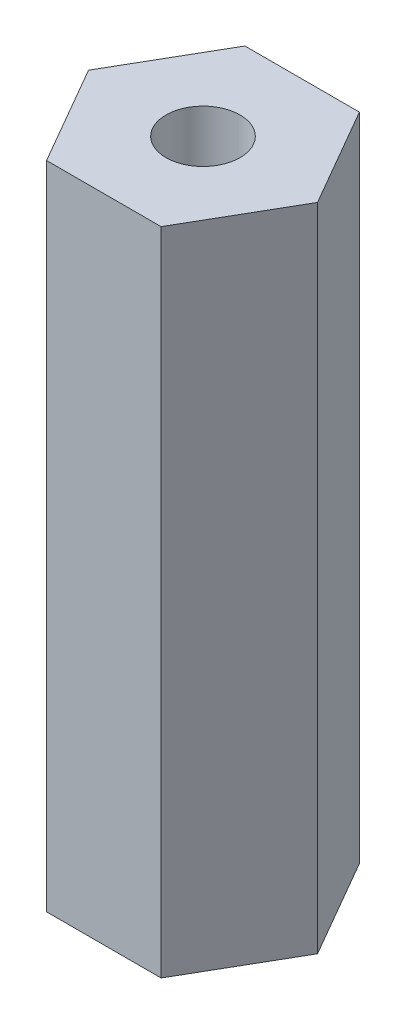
from build123d import *

# Parameters (mm, degrees)
BOSS_EXTRUDE1_DEPTH = 25.000000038
SKETCH2_R           = 1.4224
CUT_EXTRUDE1_DEPTH  = 26.668480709


with BuildPart() as part:
    # Sketch1 → Boss-Extrude1 (new body)
    with BuildSketch(Plane(origin=(0, 0, 0), x_dir=(1, 0, 0), z_dir=(0, 1, 0))):
        Polygon((4.399409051, 0), (2.199704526, 3.81), (-2.199704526, 3.81), (-4.399409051, 0), (-2.199704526, -3.81), (2.199704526, -3.81), align=None)
    extrude(amount=BOSS_EXTRUDE1_DEPTH)

    # Sketch2 → Cut-Extrude1 (cut, through all)
    with BuildSketch(Plane(origin=(0, 25.000000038, 0), x_dir=(1, 0, 0), z_dir=(0, 1, 0))):
        with Locations(Location((0, 0, 0), (0, 0, 270))):
            Circle(SKETCH2_R)
    extrude(amount=-CUT_EXTRUDE1_DEPTH, mode=Mode.SUBTRACT)


solid = part.part
